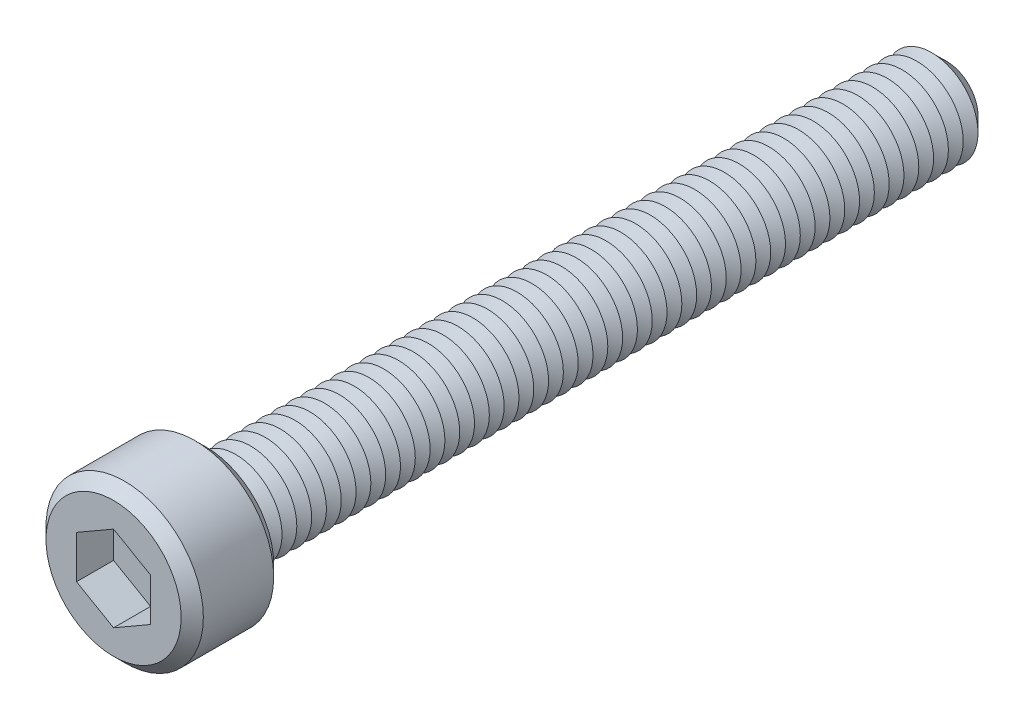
from build123d import *

# Parameters (mm, degrees)
SKETCH1_R           = 4.25
BOSS_EXTRUDE1_DEPTH = 5
SKETCH2_R           = 2.5
BOSS_EXTRUDE2_DEPTH = 40
CHAMFER1_SIZE       = 0.8
LPATTERN1_COUNT     = 49
LPATTERN1_PITCH     = 0.8
CUT_EXTRUDE1_DEPTH  = 2
SKETCH6_R           = 0.65
CUT_EXTRUDE2_DEPTH  = 43
CHAMFER2_SIZE       = 0.6


with BuildPart() as part:
    # Sketch1 → Boss-Extrude1 (new body)
    with BuildSketch(Plane.XY):
        Circle(SKETCH1_R)
    extrude(amount=BOSS_EXTRUDE1_DEPTH)

    # Sketch2 → Boss-Extrude2 (add)
    with BuildSketch(Plane(origin=(0, 0, 0), x_dir=(-1, 0, 0), z_dir=(0, 0, -1))):
        Circle(SKETCH2_R)
    extrude(amount=BOSS_EXTRUDE2_DEPTH)

    # Chamfer1
    chamfer1_edges = [part.edges().sort_by_distance(p)[0] for p in [
        (2.5, 0, -40),
    ]]
    chamfer(chamfer1_edges, length=CHAMFER1_SIZE)

    # Sketch4 → Cut-Revolve1 (revolve, cut)
    with BuildSketch(Plane(origin=(0, 0, 0), x_dir=(0, 0, -1), z_dir=(1, 0, 0)), mode=Mode.PRIVATE) as cut_revolve1_sk:
        Polygon((0, 2.5), (0.4, 1.807179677), (0.8, 2.5), align=None)
    cut_revolve1 = revolve(cut_revolve1_sk.sketch.rotate(Axis((0, 0, 2.512122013), (0, 0, -1)), 90), axis=Axis((0, 0, 2.512122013), (0, 0, -1)), mode=Mode.SUBTRACT)

    # LPattern1: Cut-Revolve1 ×49
    with Locations(*[(0, 0, -i * LPATTERN1_PITCH) for i in range(1, LPATTERN1_COUNT)]):
        add(cut_revolve1, mode=Mode.SUBTRACT)

    # Sketch5 → Cut-Extrude1 (cut)
    with BuildSketch(Plane.XY.offset(5)):
        Polygon((0, 2.309401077), (-2, 1.154700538), (-2, -1.154700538), (0, -2.309401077), (2, -1.154700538), (2, 1.154700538), align=None)
    extrude(amount=-CUT_EXTRUDE1_DEPTH, mode=Mode.SUBTRACT)

    # Sketch6 → Cut-Extrude2 (cut)
    with BuildSketch(Plane.XY.offset(3)):
        Circle(SKETCH6_R)
    extrude(amount=-CUT_EXTRUDE2_DEPTH, mode=Mode.SUBTRACT)

    # Chamfer2
    chamfer2_edges = [part.edges().sort_by_distance(p)[0] for p in [
        (-4.25, 0, 0),
        (-4.25, 0, 5),
    ]]
    chamfer(chamfer2_edges, length=CHAMFER2_SIZE)


solid = part.part
